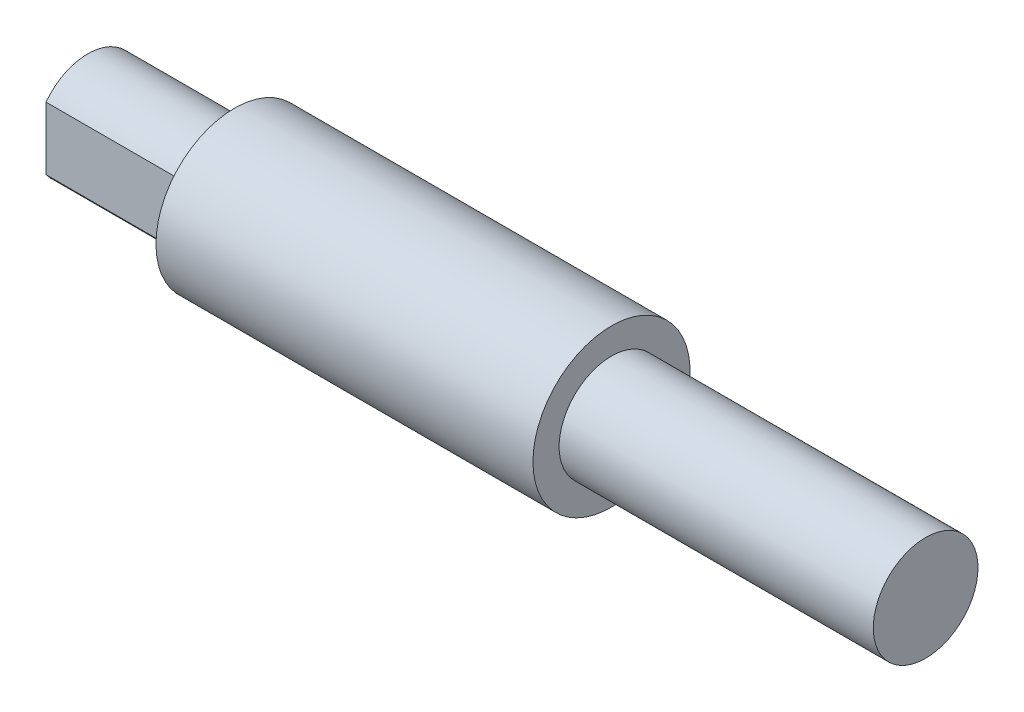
from build123d import *

# Parameters (mm, degrees)
SKETCH_1_R          = 7.5
EXTRUDE_1_DEPTH     = 80
SKETCH_2_OUTSIDE_W  = 33.552
SKETCH_2_OUTSIDE_H  = 33.552
SKETCH_2_OUTSIDE_R  = 5
CUT_EXTRUDE_1_DEPTH = 30
SKETCH_3_OUTSIDE_W  = 33.552
SKETCH_3_OUTSIDE_H  = 33.552
CUT_EXTRUDE_2_DEPTH = 14


with BuildPart() as part:
    # Sketch 1 → Extrude 1 (new body)
    with BuildSketch(Plane(origin=(0, 0, 0), x_dir=(0, 0, -1), z_dir=(1, 0, 0))):
        Circle(SKETCH_1_R)
    extrude(amount=EXTRUDE_1_DEPTH)

    # Sketch 2 outside → Cut-Extrude 1 (cut)
    with BuildSketch(Plane(origin=(80, 0, 0), x_dir=(0, 0, -1), z_dir=(1, 0, 0))):
        Rectangle(SKETCH_2_OUTSIDE_W, SKETCH_2_OUTSIDE_H)
        Circle(SKETCH_2_OUTSIDE_R, mode=Mode.SUBTRACT)
    extrude(amount=-CUT_EXTRUDE_1_DEPTH, mode=Mode.SUBTRACT)

    # Sketch 3 outside → Cut-Extrude 2 (cut)
    with BuildSketch(Plane.ZY):
        Rectangle(SKETCH_3_OUTSIDE_W, SKETCH_3_OUTSIDE_H)
        with BuildLine():
            Line((-4, 3), (-4, -3))
            ThreePointArc((-4, -3), (0, -5), (4, -3))
            Line((4, -3), (4, 3))
            ThreePointArc((4, 3), (0, 5), (-4, 3))
        make_face(mode=Mode.SUBTRACT)
    extrude(amount=-CUT_EXTRUDE_2_DEPTH, mode=Mode.SUBTRACT)


solid = part.part
